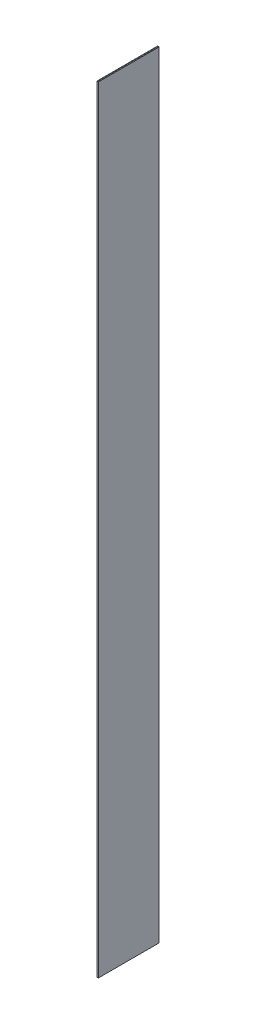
ISO-10303-21;
HEADER;
FILE_DESCRIPTION(('STEP AP214'),'2;1');
FILE_NAME('part.step','',(''),(''),'','','');
FILE_SCHEMA(('AUTOMOTIVE_DESIGN { 1 0 10303 214 1 1 1 1 }'));
ENDSEC;
DATA;
#1=APPLICATION_CONTEXT('core data for automotive mechanical design processes');
#2=APPLICATION_PROTOCOL_DEFINITION('international standard','automotive_design',2000,#1);
#3=PRODUCT_CONTEXT('',#1,'mechanical');
#4=PRODUCT('Part','Part','',(#3));
#5=PRODUCT_RELATED_PRODUCT_CATEGORY('part','',(#4));
#6=PRODUCT_DEFINITION_FORMATION('','',#4);
#7=PRODUCT_DEFINITION_CONTEXT('part definition',#1,'design');
#8=PRODUCT_DEFINITION('design','',#6,#7);
#9=PRODUCT_DEFINITION_SHAPE('','',#8);
#10=(LENGTH_UNIT() NAMED_UNIT(*) SI_UNIT(.MILLI.,.METRE.));
#11=(NAMED_UNIT(*) PLANE_ANGLE_UNIT() SI_UNIT($,.RADIAN.));
#12=(NAMED_UNIT(*) SI_UNIT($,.STERADIAN.) SOLID_ANGLE_UNIT());
#13=UNCERTAINTY_MEASURE_WITH_UNIT(LENGTH_MEASURE(1.E-05),#10,'distance_accuracy_value','');
#14=(GEOMETRIC_REPRESENTATION_CONTEXT(3) GLOBAL_UNCERTAINTY_ASSIGNED_CONTEXT((#13)) GLOBAL_UNIT_ASSIGNED_CONTEXT((#10,
#11,#12)) REPRESENTATION_CONTEXT('',''));
#15=CARTESIAN_POINT('',(0.,0.,0.));
#16=DIRECTION('',(0.,0.,1.));
#17=DIRECTION('',(1.,0.,0.));
#18=AXIS2_PLACEMENT_3D('',#15,#16,#17);
#19=CARTESIAN_POINT('',(-9.52499999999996,9739.6,381.));
#20=DIRECTION('',(1.,0.,0.));
#21=DIRECTION('',(0.,0.,-1.));
#22=AXIS2_PLACEMENT_3D('',#19,#20,#21);
#23=PLANE('',#22);
#24=DIRECTION('',(0.,-1.,0.));
#25=VECTOR('',#24,1.);
#26=CARTESIAN_POINT('',(-9.52500000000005,9739.6,-381.));
#27=LINE('',#26,#25);
#28=CARTESIAN_POINT('',(-9.52500000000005,9733.6,-381.));
#29=VERTEX_POINT('',#28);
#30=CARTESIAN_POINT('',(-9.52500000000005,6.000000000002,-381.));
#31=VERTEX_POINT('',#30);
#32=EDGE_CURVE('E170',#29,#31,#27,.T.);
#33=ORIENTED_EDGE('',*,*,#32,.T.);
#34=DIRECTION('',(0.,0.,1.));
#35=VECTOR('',#34,1.);
#36=CARTESIAN_POINT('',(-9.52499999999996,6.000000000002,381.));
#37=LINE('',#36,#35);
#38=CARTESIAN_POINT('',(-9.52499999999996,6.000000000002,381.));
#39=VERTEX_POINT('',#38);
#40=EDGE_CURVE('E182',#31,#39,#37,.T.);
#41=ORIENTED_EDGE('',*,*,#40,.T.);
#42=DIRECTION('',(0.,-1.,0.));
#43=VECTOR('',#42,1.);
#44=CARTESIAN_POINT('',(-9.52499999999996,9739.6,381.));
#45=LINE('',#44,#43);
#46=CARTESIAN_POINT('',(-9.52499999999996,9733.6,381.));
#47=VERTEX_POINT('',#46);
#48=EDGE_CURVE('E138',#47,#39,#45,.T.);
#49=ORIENTED_EDGE('',*,*,#48,.F.);
#50=DIRECTION('',(0.,0.,-1.));
#51=VECTOR('',#50,1.);
#52=CARTESIAN_POINT('',(-9.52500000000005,9733.6,-381.));
#53=LINE('',#52,#51);
#54=EDGE_CURVE('E184',#47,#29,#53,.T.);
#55=ORIENTED_EDGE('',*,*,#54,.T.);
#56=EDGE_LOOP('',(#33,#41,#49,#55));
#57=FACE_BOUND('',#56,.T.);
#58=ADVANCED_FACE('F50',(#57),#23,.F.);
#59=CARTESIAN_POINT('',(9.52500000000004,9739.6,381.));
#60=DIRECTION('',(0.,0.,-1.));
#61=DIRECTION('',(-1.,0.,0.));
#62=AXIS2_PLACEMENT_3D('',#59,#60,#61);
#63=PLANE('',#62);
#64=ORIENTED_EDGE('',*,*,#48,.T.);
#65=DIRECTION('',(1.,0.,0.));
#66=VECTOR('',#65,1.);
#67=CARTESIAN_POINT('',(9.52500000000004,6.000000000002,381.));
#68=LINE('',#67,#66);
#69=CARTESIAN_POINT('',(9.52500000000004,6.000000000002,381.));
#70=VERTEX_POINT('',#69);
#71=EDGE_CURVE('E136',#39,#70,#68,.T.);
#72=ORIENTED_EDGE('',*,*,#71,.T.);
#73=DIRECTION('',(0.,-1.,0.));
#74=VECTOR('',#73,1.);
#75=CARTESIAN_POINT('',(9.52500000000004,9739.6,381.));
#76=LINE('',#75,#74);
#77=CARTESIAN_POINT('',(9.52500000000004,9733.6,381.));
#78=VERTEX_POINT('',#77);
#79=EDGE_CURVE('E119',#78,#70,#76,.T.);
#80=ORIENTED_EDGE('',*,*,#79,.F.);
#81=DIRECTION('',(-1.,0.,0.));
#82=VECTOR('',#81,1.);
#83=CARTESIAN_POINT('',(-9.52499999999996,9733.6,381.));
#84=LINE('',#83,#82);
#85=EDGE_CURVE('E134',#78,#47,#84,.T.);
#86=ORIENTED_EDGE('',*,*,#85,.T.);
#87=EDGE_LOOP('',(#64,#72,#80,#86));
#88=FACE_BOUND('',#87,.T.);
#89=ADVANCED_FACE('F132',(#88),#63,.F.);
#90=CARTESIAN_POINT('',(9.52500000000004,9739.6,381.));
#91=DIRECTION('',(-1.,0.,0.));
#92=DIRECTION('',(0.,0.,1.));
#93=AXIS2_PLACEMENT_3D('',#90,#91,#92);
#94=PLANE('',#93);
#95=ORIENTED_EDGE('',*,*,#79,.T.);
#96=DIRECTION('',(0.,0.,-1.));
#97=VECTOR('',#96,1.);
#98=CARTESIAN_POINT('',(9.52500000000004,6.000000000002,381.));
#99=LINE('',#98,#97);
#100=CARTESIAN_POINT('',(9.52499999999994,6.000000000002,-381.));
#101=VERTEX_POINT('',#100);
#102=EDGE_CURVE('E124',#70,#101,#99,.T.);
#103=ORIENTED_EDGE('',*,*,#102,.T.);
#104=DIRECTION('',(0.,-1.,0.));
#105=VECTOR('',#104,1.);
#106=CARTESIAN_POINT('',(9.52499999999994,9739.6,-381.));
#107=LINE('',#106,#105);
#108=CARTESIAN_POINT('',(9.52499999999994,9733.6,-381.));
#109=VERTEX_POINT('',#108);
#110=EDGE_CURVE('E120',#109,#101,#107,.T.);
#111=ORIENTED_EDGE('',*,*,#110,.F.);
#112=DIRECTION('',(0.,0.,1.));
#113=VECTOR('',#112,1.);
#114=CARTESIAN_POINT('',(9.52500000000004,9733.6,381.));
#115=LINE('',#114,#113);
#116=EDGE_CURVE('E113',#109,#78,#115,.T.);
#117=ORIENTED_EDGE('',*,*,#116,.T.);
#118=EDGE_LOOP('',(#95,#103,#111,#117));
#119=FACE_BOUND('',#118,.T.);
#120=ADVANCED_FACE('F117',(#119),#94,.F.);
#121=CARTESIAN_POINT('',(9.52499999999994,9739.6,-381.));
#122=DIRECTION('',(0.,0.,1.));
#123=DIRECTION('',(1.,0.,0.));
#124=AXIS2_PLACEMENT_3D('',#121,#122,#123);
#125=PLANE('',#124);
#126=ORIENTED_EDGE('',*,*,#110,.T.);
#127=DIRECTION('',(-1.,0.,0.));
#128=VECTOR('',#127,1.);
#129=CARTESIAN_POINT('',(9.52499999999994,6.000000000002,-381.));
#130=LINE('',#129,#128);
#131=EDGE_CURVE('E187',#101,#31,#130,.T.);
#132=ORIENTED_EDGE('',*,*,#131,.T.);
#133=ORIENTED_EDGE('',*,*,#32,.F.);
#134=DIRECTION('',(1.,0.,0.));
#135=VECTOR('',#134,1.);
#136=CARTESIAN_POINT('',(9.52499999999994,9733.6,-381.));
#137=LINE('',#136,#135);
#138=EDGE_CURVE('E190',#29,#109,#137,.T.);
#139=ORIENTED_EDGE('',*,*,#138,.T.);
#140=EDGE_LOOP('',(#126,#132,#133,#139));
#141=FACE_BOUND('',#140,.T.);
#142=ADVANCED_FACE('F236',(#141),#125,.F.);
#143=CARTESIAN_POINT('',(0.,9739.6,0.));
#144=DIRECTION('',(0.,1.,0.));
#145=DIRECTION('',(0.,0.,1.));
#146=AXIS2_PLACEMENT_3D('',#143,#144,#145);
#147=PLANE('',#146);
#148=DIRECTION('',(0.,0.,-1.));
#149=VECTOR('',#148,1.);
#150=CARTESIAN_POINT('',(3.52499999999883,9739.6,-381.));
#151=LINE('',#150,#149);
#152=CARTESIAN_POINT('',(3.52499999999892,9739.6,374.999999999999));
#153=VERTEX_POINT('',#152);
#154=CARTESIAN_POINT('',(3.52499999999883,9739.6,-374.999999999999));
#155=VERTEX_POINT('',#154);
#156=EDGE_CURVE('E59',#153,#155,#151,.T.);
#157=ORIENTED_EDGE('',*,*,#156,.T.);
#158=DIRECTION('',(-1.,0.,0.));
#159=VECTOR('',#158,1.);
#160=CARTESIAN_POINT('',(-9.52500000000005,9739.6,-374.999999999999));
#161=LINE('',#160,#159);
#162=CARTESIAN_POINT('',(-3.52499999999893,9739.6,-374.999999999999));
#163=VERTEX_POINT('',#162);
#164=EDGE_CURVE('E11',#155,#163,#161,.T.);
#165=ORIENTED_EDGE('',*,*,#164,.T.);
#166=DIRECTION('',(0.,0.,1.));
#167=VECTOR('',#166,1.);
#168=CARTESIAN_POINT('',(-3.52499999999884,9739.6,381.));
#169=LINE('',#168,#167);
#170=CARTESIAN_POINT('',(-3.52499999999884,9739.6,374.999999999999));
#171=VERTEX_POINT('',#170);
#172=EDGE_CURVE('E178',#163,#171,#169,.T.);
#173=ORIENTED_EDGE('',*,*,#172,.T.);
#174=DIRECTION('',(1.,0.,0.));
#175=VECTOR('',#174,1.);
#176=CARTESIAN_POINT('',(9.52500000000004,9739.6,374.999999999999));
#177=LINE('',#176,#175);
#178=EDGE_CURVE('E67',#171,#153,#177,.T.);
#179=ORIENTED_EDGE('',*,*,#178,.T.);
#180=EDGE_LOOP('',(#157,#165,#173,#179));
#181=FACE_BOUND('',#180,.T.);
#182=ADVANCED_FACE('F243',(#181),#147,.T.);
#183=CARTESIAN_POINT('',(0.,0.,0.));
#184=DIRECTION('',(0.,1.,0.));
#185=DIRECTION('',(0.,0.,1.));
#186=AXIS2_PLACEMENT_3D('',#183,#184,#185);
#187=PLANE('',#186);
#188=DIRECTION('',(0.,0.,1.));
#189=VECTOR('',#188,1.);
#190=CARTESIAN_POINT('',(3.52499999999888,0.,0.));
#191=LINE('',#190,#189);
#192=CARTESIAN_POINT('',(3.52499999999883,0.,-374.999999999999));
#193=VERTEX_POINT('',#192);
#194=CARTESIAN_POINT('',(3.52499999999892,0.,374.999999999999));
#195=VERTEX_POINT('',#194);
#196=EDGE_CURVE('E196',#193,#195,#191,.T.);
#197=ORIENTED_EDGE('',*,*,#196,.T.);
#198=DIRECTION('',(-1.,0.,0.));
#199=VECTOR('',#198,1.);
#200=CARTESIAN_POINT('',(0.,0.,374.999999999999));
#201=LINE('',#200,#199);
#202=CARTESIAN_POINT('',(-3.52499999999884,0.,374.999999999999));
#203=VERTEX_POINT('',#202);
#204=EDGE_CURVE('E127',#195,#203,#201,.T.);
#205=ORIENTED_EDGE('',*,*,#204,.T.);
#206=DIRECTION('',(0.,0.,-1.));
#207=VECTOR('',#206,1.);
#208=CARTESIAN_POINT('',(-3.52499999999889,0.,0.));
#209=LINE('',#208,#207);
#210=CARTESIAN_POINT('',(-3.52499999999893,0.,-374.999999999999));
#211=VERTEX_POINT('',#210);
#212=EDGE_CURVE('E204',#203,#211,#209,.T.);
#213=ORIENTED_EDGE('',*,*,#212,.T.);
#214=DIRECTION('',(1.,0.,0.));
#215=VECTOR('',#214,1.);
#216=CARTESIAN_POINT('',(0.,0.,-374.999999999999));
#217=LINE('',#216,#215);
#218=EDGE_CURVE('E203',#211,#193,#217,.T.);
#219=ORIENTED_EDGE('',*,*,#218,.T.);
#220=EDGE_LOOP('',(#197,#205,#213,#219));
#221=FACE_BOUND('',#220,.T.);
#222=ADVANCED_FACE('F246',(#221),#187,.F.);
#223=CARTESIAN_POINT('',(9.52499999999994,6.000000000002,-381.));
#224=DIRECTION('',(0.,0.707106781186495,0.7071067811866));
#225=DIRECTION('',(-1.,0.,0.));
#226=AXIS2_PLACEMENT_3D('',#223,#224,#225);
#227=PLANE('',#226);
#228=DIRECTION('',(-0.577350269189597,-0.577350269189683,0.577350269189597));
#229=VECTOR('',#228,1.);
#230=CARTESIAN_POINT('',(9.52499999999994,6.000000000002,-381.));
#231=LINE('',#230,#229);
#232=EDGE_CURVE('E169',#193,#101,#231,.F.);
#233=ORIENTED_EDGE('',*,*,#232,.F.);
#234=ORIENTED_EDGE('',*,*,#218,.F.);
#235=DIRECTION('',(0.577350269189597,-0.577350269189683,0.577350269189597));
#236=VECTOR('',#235,1.);
#237=CARTESIAN_POINT('',(244.474999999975,-248.000000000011,-127.000000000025));
#238=LINE('',#237,#236);
#239=EDGE_CURVE('E162',#31,#211,#238,.T.);
#240=ORIENTED_EDGE('',*,*,#239,.F.);
#241=ORIENTED_EDGE('',*,*,#131,.F.);
#242=EDGE_LOOP('',(#233,#234,#240,#241));
#243=FACE_BOUND('',#242,.T.);
#244=ADVANCED_FACE('F223',(#243),#227,.F.);
#245=CARTESIAN_POINT('',(-9.52499999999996,6.000000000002,381.));
#246=DIRECTION('',(0.7071067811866,0.707106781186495,0.));
#247=DIRECTION('',(0.,0.,1.));
#248=AXIS2_PLACEMENT_3D('',#245,#246,#247);
#249=PLANE('',#248);
#250=ORIENTED_EDGE('',*,*,#239,.T.);
#251=ORIENTED_EDGE('',*,*,#212,.F.);
#252=DIRECTION('',(-0.577350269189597,0.577350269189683,0.577350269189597));
#253=VECTOR('',#252,1.);
#254=CARTESIAN_POINT('',(-9.52499999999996,6.000000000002,381.));
#255=LINE('',#254,#253);
#256=EDGE_CURVE('E155',#39,#203,#255,.F.);
#257=ORIENTED_EDGE('',*,*,#256,.F.);
#258=ORIENTED_EDGE('',*,*,#40,.F.);
#259=EDGE_LOOP('',(#250,#251,#257,#258));
#260=FACE_BOUND('',#259,.T.);
#261=ADVANCED_FACE('F228',(#260),#249,.F.);
#262=CARTESIAN_POINT('',(9.52500000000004,6.000000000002,381.));
#263=DIRECTION('',(-0.7071067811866,0.707106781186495,0.));
#264=DIRECTION('',(0.,0.,-1.));
#265=AXIS2_PLACEMENT_3D('',#262,#263,#264);
#266=PLANE('',#265);
#267=ORIENTED_EDGE('',*,*,#232,.T.);
#268=ORIENTED_EDGE('',*,*,#102,.F.);
#269=DIRECTION('',(-0.577350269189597,-0.577350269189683,-0.577350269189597));
#270=VECTOR('',#269,1.);
#271=CARTESIAN_POINT('',(9.52500000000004,6.000000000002,381.));
#272=LINE('',#271,#270);
#273=EDGE_CURVE('E149',#195,#70,#272,.F.);
#274=ORIENTED_EDGE('',*,*,#273,.F.);
#275=ORIENTED_EDGE('',*,*,#196,.F.);
#276=EDGE_LOOP('',(#267,#268,#274,#275));
#277=FACE_BOUND('',#276,.T.);
#278=ADVANCED_FACE('F240',(#277),#266,.F.);
#279=CARTESIAN_POINT('',(9.52500000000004,6.000000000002,381.));
#280=DIRECTION('',(0.,0.707106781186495,-0.7071067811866));
#281=DIRECTION('',(1.,0.,0.));
#282=AXIS2_PLACEMENT_3D('',#279,#280,#281);
#283=PLANE('',#282);
#284=ORIENTED_EDGE('',*,*,#256,.T.);
#285=ORIENTED_EDGE('',*,*,#204,.F.);
#286=ORIENTED_EDGE('',*,*,#273,.T.);
#287=ORIENTED_EDGE('',*,*,#71,.F.);
#288=EDGE_LOOP('',(#284,#285,#286,#287));
#289=FACE_BOUND('',#288,.T.);
#290=ADVANCED_FACE('F235',(#289),#283,.F.);
#291=CARTESIAN_POINT('',(0.,9739.6,374.999999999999));
#292=DIRECTION('',(0.,0.707106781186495,0.7071067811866));
#293=DIRECTION('',(-1.,0.,0.));
#294=AXIS2_PLACEMENT_3D('',#291,#292,#293);
#295=PLANE('',#294);
#296=DIRECTION('',(0.577350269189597,0.577350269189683,-0.577350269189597));
#297=VECTOR('',#296,1.);
#298=CARTESIAN_POINT('',(121.474999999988,9864.60000000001,250.000000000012));
#299=LINE('',#298,#297);
#300=EDGE_CURVE('E141',#47,#171,#299,.T.);
#301=ORIENTED_EDGE('',*,*,#300,.F.);
#302=ORIENTED_EDGE('',*,*,#85,.F.);
#303=DIRECTION('',(-0.577350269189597,0.577350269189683,-0.577350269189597));
#304=VECTOR('',#303,1.);
#305=CARTESIAN_POINT('',(2.3499999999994,9740.775,373.824999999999));
#306=LINE('',#305,#304);
#307=EDGE_CURVE('E55',#153,#78,#306,.F.);
#308=ORIENTED_EDGE('',*,*,#307,.F.);
#309=ORIENTED_EDGE('',*,*,#178,.F.);
#310=EDGE_LOOP('',(#301,#302,#308,#309));
#311=FACE_BOUND('',#310,.T.);
#312=ADVANCED_FACE('F49',(#311),#295,.T.);
#313=CARTESIAN_POINT('',(3.52499999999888,9739.6,0.));
#314=DIRECTION('',(0.7071067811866,0.707106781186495,0.));
#315=DIRECTION('',(0.,0.,1.));
#316=AXIS2_PLACEMENT_3D('',#313,#314,#315);
#317=PLANE('',#316);
#318=ORIENTED_EDGE('',*,*,#307,.T.);
#319=ORIENTED_EDGE('',*,*,#116,.F.);
#320=DIRECTION('',(-0.577350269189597,0.577350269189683,0.577350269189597));
#321=VECTOR('',#320,1.);
#322=CARTESIAN_POINT('',(-121.474999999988,9864.60000000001,-250.000000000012));
#323=LINE('',#322,#321);
#324=EDGE_CURVE('E152',#155,#109,#323,.F.);
#325=ORIENTED_EDGE('',*,*,#324,.F.);
#326=ORIENTED_EDGE('',*,*,#156,.F.);
#327=EDGE_LOOP('',(#318,#319,#325,#326));
#328=FACE_BOUND('',#327,.T.);
#329=ADVANCED_FACE('F150',(#328),#317,.T.);
#330=CARTESIAN_POINT('',(-3.52499999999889,9739.6,0.));
#331=DIRECTION('',(-0.7071067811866,0.707106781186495,0.));
#332=DIRECTION('',(0.,0.,-1.));
#333=AXIS2_PLACEMENT_3D('',#330,#331,#332);
#334=PLANE('',#333);
#335=ORIENTED_EDGE('',*,*,#300,.T.);
#336=ORIENTED_EDGE('',*,*,#172,.F.);
#337=DIRECTION('',(-0.577350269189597,-0.577350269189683,-0.577350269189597));
#338=VECTOR('',#337,1.);
#339=CARTESIAN_POINT('',(121.474999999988,9864.60000000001,-250.000000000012));
#340=LINE('',#339,#338);
#341=EDGE_CURVE('E158',#29,#163,#340,.F.);
#342=ORIENTED_EDGE('',*,*,#341,.F.);
#343=ORIENTED_EDGE('',*,*,#54,.F.);
#344=EDGE_LOOP('',(#335,#336,#342,#343));
#345=FACE_BOUND('',#344,.T.);
#346=ADVANCED_FACE('F244',(#345),#334,.T.);
#347=CARTESIAN_POINT('',(0.,9739.6,-374.999999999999));
#348=DIRECTION('',(0.,0.707106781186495,-0.7071067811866));
#349=DIRECTION('',(1.,0.,0.));
#350=AXIS2_PLACEMENT_3D('',#347,#348,#349);
#351=PLANE('',#350);
#352=ORIENTED_EDGE('',*,*,#324,.T.);
#353=ORIENTED_EDGE('',*,*,#138,.F.);
#354=ORIENTED_EDGE('',*,*,#341,.T.);
#355=ORIENTED_EDGE('',*,*,#164,.F.);
#356=EDGE_LOOP('',(#352,#353,#354,#355));
#357=FACE_BOUND('',#356,.T.);
#358=ADVANCED_FACE('F241',(#357),#351,.T.);
#359=CLOSED_SHELL('',(#58,#89,#120,#142,#182,#222,#244,#261,#278,#290,#312,#329,#346,#358));
#360=MANIFOLD_SOLID_BREP('B2',#359);
#361=ADVANCED_BREP_SHAPE_REPRESENTATION('',(#18,#360),#14);
#362=SHAPE_DEFINITION_REPRESENTATION(#9,#361);
ENDSEC;
END-ISO-10303-21;
